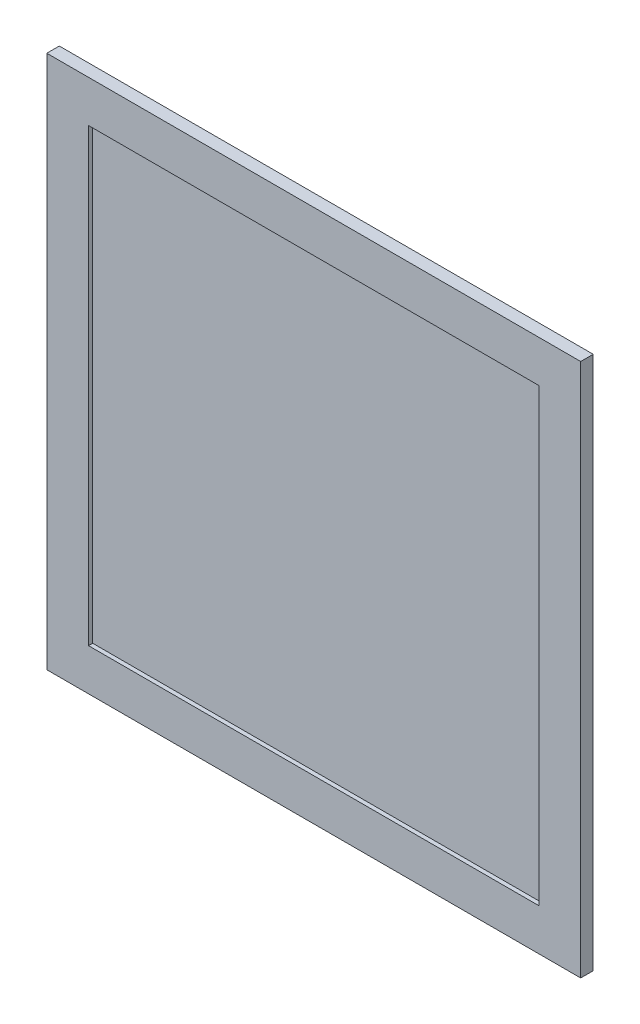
from build123d import *

# Parameters (mm, degrees)
SKETCH1_W      = 128
SKETCH1_H      = 128
EXTRUDE1_DEPTH = 0.5
SKETCH2_W      = 128
SKETCH2_H      = 128
SKETCH2_W_2    = 108
SKETCH2_H_2    = 108
EXTRUDE2_DEPTH = 1.5


with BuildPart() as part:
    # Sketch1 → Extrude1 (new, symmetric)
    with BuildSketch(Plane.XY):
        Rectangle(SKETCH1_W, SKETCH1_H)
    extrude(amount=EXTRUDE1_DEPTH, both=True)

    # Sketch2 → Extrude2 (add, symmetric)
    with BuildSketch(Plane.XY):
        Rectangle(SKETCH2_W, SKETCH2_H)
        Rectangle(SKETCH2_W_2, SKETCH2_H_2, mode=Mode.SUBTRACT)
    extrude(amount=EXTRUDE2_DEPTH, both=True)


solid = part.part
